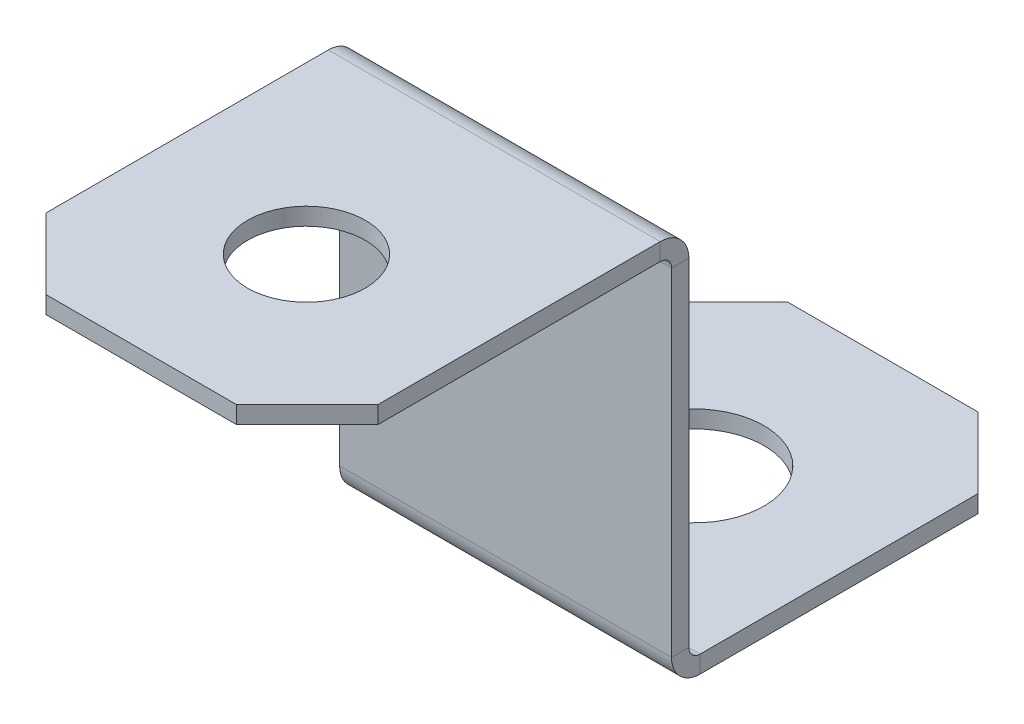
ISO-10303-21;
HEADER;
FILE_DESCRIPTION(('STEP AP214'),'2;1');
FILE_NAME('part.step','',(''),(''),'','','');
FILE_SCHEMA(('AUTOMOTIVE_DESIGN { 1 0 10303 214 1 1 1 1 }'));
ENDSEC;
DATA;
#1=APPLICATION_CONTEXT('core data for automotive mechanical design processes');
#2=APPLICATION_PROTOCOL_DEFINITION('international standard','automotive_design',2000,#1);
#3=PRODUCT_CONTEXT('',#1,'mechanical');
#4=PRODUCT('Part','Part','',(#3));
#5=PRODUCT_RELATED_PRODUCT_CATEGORY('part','',(#4));
#6=PRODUCT_DEFINITION_FORMATION('','',#4);
#7=PRODUCT_DEFINITION_CONTEXT('part definition',#1,'design');
#8=PRODUCT_DEFINITION('design','',#6,#7);
#9=PRODUCT_DEFINITION_SHAPE('','',#8);
#10=(LENGTH_UNIT() NAMED_UNIT(*) SI_UNIT(.MILLI.,.METRE.));
#11=(NAMED_UNIT(*) PLANE_ANGLE_UNIT() SI_UNIT($,.RADIAN.));
#12=(NAMED_UNIT(*) SI_UNIT($,.STERADIAN.) SOLID_ANGLE_UNIT());
#13=UNCERTAINTY_MEASURE_WITH_UNIT(LENGTH_MEASURE(1.E-05),#10,'distance_accuracy_value','');
#14=(GEOMETRIC_REPRESENTATION_CONTEXT(3) GLOBAL_UNCERTAINTY_ASSIGNED_CONTEXT((#13)) GLOBAL_UNIT_ASSIGNED_CONTEXT((#10,
#11,#12)) REPRESENTATION_CONTEXT('',''));
#15=CARTESIAN_POINT('',(0.,0.,0.));
#16=DIRECTION('',(0.,0.,1.));
#17=DIRECTION('',(1.,0.,0.));
#18=AXIS2_PLACEMENT_3D('',#15,#16,#17);
#19=CARTESIAN_POINT('',(5.588,-0.9652,-7.2898));
#20=DIRECTION('',(1.,0.,0.));
#21=DIRECTION('',(0.,0.,-1.));
#22=AXIS2_PLACEMENT_3D('',#19,#20,#21);
#23=PLANE('',#22);
#24=DIRECTION('',(0.,0.,1.));
#25=VECTOR('',#24,1.);
#26=CARTESIAN_POINT('',(5.588,-0.9652,-7.2898));
#27=LINE('',#26,#25);
#28=CARTESIAN_POINT('',(5.588,-0.9652,-7.2898));
#29=VERTEX_POINT('',#28);
#30=CARTESIAN_POINT('',(5.588,-0.9652,-6.7056));
#31=VERTEX_POINT('',#30);
#32=EDGE_CURVE('E272',#29,#31,#27,.T.);
#33=ORIENTED_EDGE('',*,*,#32,.F.);
#34=CARTESIAN_POINT('',(5.588,-0.9652,-6.3246));
#35=DIRECTION('',(1.,0.,0.));
#36=DIRECTION('',(0.,0.,-1.));
#37=AXIS2_PLACEMENT_3D('',#34,#35,#36);
#38=CIRCLE('',#37,0.9652);
#39=CARTESIAN_POINT('',(5.588,0.,-6.3246));
#40=VERTEX_POINT('',#39);
#41=EDGE_CURVE('E189',#40,#29,#38,.F.);
#42=ORIENTED_EDGE('',*,*,#41,.F.);
#43=DIRECTION('',(0.,1.,0.));
#44=VECTOR('',#43,1.);
#45=CARTESIAN_POINT('',(5.588,-0.5842,-6.3246));
#46=LINE('',#45,#44);
#47=CARTESIAN_POINT('',(5.588,-0.5842,-6.3246));
#48=VERTEX_POINT('',#47);
#49=EDGE_CURVE('E269',#48,#40,#46,.T.);
#50=ORIENTED_EDGE('',*,*,#49,.F.);
#51=CARTESIAN_POINT('',(5.588,-0.9652,-6.3246));
#52=DIRECTION('',(1.,0.,0.));
#53=DIRECTION('',(0.,0.,-1.));
#54=AXIS2_PLACEMENT_3D('',#51,#52,#53);
#55=CIRCLE('',#54,0.381);
#56=EDGE_CURVE('E199',#48,#31,#55,.F.);
#57=ORIENTED_EDGE('',*,*,#56,.T.);
#58=EDGE_LOOP('',(#33,#42,#50,#57));
#59=FACE_BOUND('',#58,.T.);
#60=ADVANCED_FACE('F39',(#59),#23,.T.);
#61=CARTESIAN_POINT('',(5.588,-0.5842,-6.3246));
#62=DIRECTION('',(1.,0.,0.));
#63=DIRECTION('',(0.,0.,-1.));
#64=AXIS2_PLACEMENT_3D('',#61,#62,#63);
#65=PLANE('',#64);
#66=DIRECTION('',(0.,-1.,0.));
#67=VECTOR('',#66,1.);
#68=CARTESIAN_POINT('',(5.588,0.,-7.2898));
#69=LINE('',#68,#67);
#70=CARTESIAN_POINT('',(5.588,-12.319,-7.2898));
#71=VERTEX_POINT('',#70);
#72=EDGE_CURVE('E187',#29,#71,#69,.T.);
#73=ORIENTED_EDGE('',*,*,#72,.F.);
#74=ORIENTED_EDGE('',*,*,#32,.T.);
#75=DIRECTION('',(0.,-1.,0.));
#76=VECTOR('',#75,1.);
#77=CARTESIAN_POINT('',(5.588,0.,-6.7056));
#78=LINE('',#77,#76);
#79=CARTESIAN_POINT('',(5.588,-12.319,-6.7056));
#80=VERTEX_POINT('',#79);
#81=EDGE_CURVE('E202',#31,#80,#78,.T.);
#82=ORIENTED_EDGE('',*,*,#81,.T.);
#83=DIRECTION('',(0.,0.,-1.));
#84=VECTOR('',#83,1.);
#85=CARTESIAN_POINT('',(5.588,-12.319,-6.7056));
#86=LINE('',#85,#84);
#87=EDGE_CURVE('E164',#80,#71,#86,.T.);
#88=ORIENTED_EDGE('',*,*,#87,.T.);
#89=EDGE_LOOP('',(#73,#74,#82,#88));
#90=FACE_BOUND('',#89,.T.);
#91=ADVANCED_FACE('F349',(#90),#65,.T.);
#92=CARTESIAN_POINT('',(-5.588,0.,-6.3246));
#93=DIRECTION('',(-1.,0.,0.));
#94=DIRECTION('',(0.,0.,1.));
#95=AXIS2_PLACEMENT_3D('',#92,#93,#94);
#96=PLANE('',#95);
#97=DIRECTION('',(0.,-1.,0.));
#98=VECTOR('',#97,1.);
#99=CARTESIAN_POINT('',(-5.588,0.,-6.3246));
#100=LINE('',#99,#98);
#101=CARTESIAN_POINT('',(-5.588,0.,-6.3246));
#102=VERTEX_POINT('',#101);
#103=CARTESIAN_POINT('',(-5.588,-0.5842,-6.3246));
#104=VERTEX_POINT('',#103);
#105=EDGE_CURVE('E266',#102,#104,#100,.T.);
#106=ORIENTED_EDGE('',*,*,#105,.F.);
#107=CARTESIAN_POINT('',(-5.588,-0.9652,-6.3246));
#108=DIRECTION('',(1.,0.,0.));
#109=DIRECTION('',(0.,0.,-1.));
#110=AXIS2_PLACEMENT_3D('',#107,#108,#109);
#111=CIRCLE('',#110,0.9652);
#112=CARTESIAN_POINT('',(-5.588,-0.9652,-7.2898));
#113=VERTEX_POINT('',#112);
#114=EDGE_CURVE('E217',#102,#113,#111,.F.);
#115=ORIENTED_EDGE('',*,*,#114,.T.);
#116=DIRECTION('',(0.,0.,-1.));
#117=VECTOR('',#116,1.);
#118=CARTESIAN_POINT('',(-5.588,-0.9652,-6.7056));
#119=LINE('',#118,#117);
#120=CARTESIAN_POINT('',(-5.588,-0.9652,-6.7056));
#121=VERTEX_POINT('',#120);
#122=EDGE_CURVE('E163',#121,#113,#119,.T.);
#123=ORIENTED_EDGE('',*,*,#122,.F.);
#124=CARTESIAN_POINT('',(-5.588,-0.9652,-6.3246));
#125=DIRECTION('',(1.,0.,0.));
#126=DIRECTION('',(0.,0.,-1.));
#127=AXIS2_PLACEMENT_3D('',#124,#125,#126);
#128=CIRCLE('',#127,0.381);
#129=EDGE_CURVE('E224',#104,#121,#128,.F.);
#130=ORIENTED_EDGE('',*,*,#129,.F.);
#131=EDGE_LOOP('',(#106,#115,#123,#130));
#132=FACE_BOUND('',#131,.T.);
#133=ADVANCED_FACE('F355',(#132),#96,.T.);
#134=CARTESIAN_POINT('',(-5.588,-0.9652,-6.7056));
#135=DIRECTION('',(-1.,0.,0.));
#136=DIRECTION('',(0.,0.,1.));
#137=AXIS2_PLACEMENT_3D('',#134,#135,#136);
#138=PLANE('',#137);
#139=DIRECTION('',(0.,0.,-1.));
#140=VECTOR('',#139,1.);
#141=CARTESIAN_POINT('',(-5.588,-0.5842,5.5626));
#142=LINE('',#141,#140);
#143=CARTESIAN_POINT('',(-5.588,-0.5842,3.18135));
#144=VERTEX_POINT('',#143);
#145=EDGE_CURVE('E222',#144,#104,#142,.T.);
#146=ORIENTED_EDGE('',*,*,#145,.F.);
#147=DIRECTION('',(0.,1.,0.));
#148=VECTOR('',#147,1.);
#149=CARTESIAN_POINT('',(-5.588,-0.9652,3.18135));
#150=LINE('',#149,#148);
#151=CARTESIAN_POINT('',(-5.588,0.,3.18135));
#152=VERTEX_POINT('',#151);
#153=EDGE_CURVE('E274',#144,#152,#150,.T.);
#154=ORIENTED_EDGE('',*,*,#153,.T.);
#155=DIRECTION('',(0.,0.,-1.));
#156=VECTOR('',#155,1.);
#157=CARTESIAN_POINT('',(-5.588,0.,5.5626));
#158=LINE('',#157,#156);
#159=EDGE_CURVE('E220',#152,#102,#158,.T.);
#160=ORIENTED_EDGE('',*,*,#159,.T.);
#161=ORIENTED_EDGE('',*,*,#105,.T.);
#162=EDGE_LOOP('',(#146,#154,#160,#161));
#163=FACE_BOUND('',#162,.T.);
#164=ADVANCED_FACE('F453',(#163),#138,.T.);
#165=CARTESIAN_POINT('',(5.588,-12.7,-7.6708));
#166=DIRECTION('',(1.,0.,0.));
#167=DIRECTION('',(0.,0.,-1.));
#168=AXIS2_PLACEMENT_3D('',#165,#166,#167);
#169=PLANE('',#168);
#170=DIRECTION('',(0.,-1.,0.));
#171=VECTOR('',#170,1.);
#172=CARTESIAN_POINT('',(5.588,-12.7,-7.6708));
#173=LINE('',#172,#171);
#174=CARTESIAN_POINT('',(5.588,-12.7,-7.6708));
#175=VERTEX_POINT('',#174);
#176=CARTESIAN_POINT('',(5.588,-13.2842,-7.6708));
#177=VERTEX_POINT('',#176);
#178=EDGE_CURVE('E154',#175,#177,#173,.T.);
#179=ORIENTED_EDGE('',*,*,#178,.F.);
#180=CARTESIAN_POINT('',(5.588,-12.319,-7.6708));
#181=DIRECTION('',(-1.,0.,0.));
#182=DIRECTION('',(0.,0.,1.));
#183=AXIS2_PLACEMENT_3D('',#180,#181,#182);
#184=CIRCLE('',#183,0.381);
#185=EDGE_CURVE('E158',#71,#175,#184,.F.);
#186=ORIENTED_EDGE('',*,*,#185,.F.);
#187=ORIENTED_EDGE('',*,*,#87,.F.);
#188=CARTESIAN_POINT('',(5.588,-12.319,-7.6708));
#189=DIRECTION('',(1.,0.,0.));
#190=DIRECTION('',(0.,0.,-1.));
#191=AXIS2_PLACEMENT_3D('',#188,#189,#190);
#192=CIRCLE('',#191,0.9652);
#193=EDGE_CURVE('E161',#80,#177,#192,.T.);
#194=ORIENTED_EDGE('',*,*,#193,.T.);
#195=EDGE_LOOP('',(#179,#186,#187,#194));
#196=FACE_BOUND('',#195,.T.);
#197=ADVANCED_FACE('F156',(#196),#169,.T.);
#198=CARTESIAN_POINT('',(5.588,-12.319,-6.7056));
#199=DIRECTION('',(1.,0.,0.));
#200=DIRECTION('',(0.,0.,-1.));
#201=AXIS2_PLACEMENT_3D('',#198,#199,#200);
#202=PLANE('',#201);
#203=DIRECTION('',(0.,0.,-1.));
#204=VECTOR('',#203,1.);
#205=CARTESIAN_POINT('',(5.588,-13.2842,-7.2898));
#206=LINE('',#205,#204);
#207=CARTESIAN_POINT('',(5.588,-13.2842,-17.02435));
#208=VERTEX_POINT('',#207);
#209=EDGE_CURVE('E182',#177,#208,#206,.T.);
#210=ORIENTED_EDGE('',*,*,#209,.T.);
#211=DIRECTION('',(0.,1.,0.));
#212=VECTOR('',#211,1.);
#213=CARTESIAN_POINT('',(5.588,-12.319,-17.02435));
#214=LINE('',#213,#212);
#215=CARTESIAN_POINT('',(5.588,-12.7,-17.02435));
#216=VERTEX_POINT('',#215);
#217=EDGE_CURVE('E11',#208,#216,#214,.T.);
#218=ORIENTED_EDGE('',*,*,#217,.T.);
#219=DIRECTION('',(0.,0.,-1.));
#220=VECTOR('',#219,1.);
#221=CARTESIAN_POINT('',(5.588,-12.7,-7.2898));
#222=LINE('',#221,#220);
#223=EDGE_CURVE('E171',#175,#216,#222,.T.);
#224=ORIENTED_EDGE('',*,*,#223,.F.);
#225=ORIENTED_EDGE('',*,*,#178,.T.);
#226=EDGE_LOOP('',(#210,#218,#224,#225));
#227=FACE_BOUND('',#226,.T.);
#228=ADVANCED_FACE('F181',(#227),#202,.T.);
#229=CARTESIAN_POINT('',(-5.588,-12.319,-7.2898));
#230=DIRECTION('',(-1.,0.,0.));
#231=DIRECTION('',(0.,0.,1.));
#232=AXIS2_PLACEMENT_3D('',#229,#230,#231);
#233=PLANE('',#232);
#234=DIRECTION('',(0.,0.,1.));
#235=VECTOR('',#234,1.);
#236=CARTESIAN_POINT('',(-5.588,-12.319,-7.2898));
#237=LINE('',#236,#235);
#238=CARTESIAN_POINT('',(-5.588,-12.319,-7.2898));
#239=VERTEX_POINT('',#238);
#240=CARTESIAN_POINT('',(-5.588,-12.319,-6.7056));
#241=VERTEX_POINT('',#240);
#242=EDGE_CURVE('E262',#239,#241,#237,.T.);
#243=ORIENTED_EDGE('',*,*,#242,.F.);
#244=CARTESIAN_POINT('',(-5.588,-12.319,-7.6708));
#245=DIRECTION('',(-1.,0.,0.));
#246=DIRECTION('',(0.,0.,1.));
#247=AXIS2_PLACEMENT_3D('',#244,#245,#246);
#248=CIRCLE('',#247,0.381);
#249=CARTESIAN_POINT('',(-5.588,-12.7,-7.6708));
#250=VERTEX_POINT('',#249);
#251=EDGE_CURVE('E212',#239,#250,#248,.F.);
#252=ORIENTED_EDGE('',*,*,#251,.T.);
#253=DIRECTION('',(0.,1.,0.));
#254=VECTOR('',#253,1.);
#255=CARTESIAN_POINT('',(-5.588,-13.2842,-7.6708));
#256=LINE('',#255,#254);
#257=CARTESIAN_POINT('',(-5.588,-13.2842,-7.6708));
#258=VERTEX_POINT('',#257);
#259=EDGE_CURVE('E260',#258,#250,#256,.T.);
#260=ORIENTED_EDGE('',*,*,#259,.F.);
#261=CARTESIAN_POINT('',(-5.588,-12.319,-7.6708));
#262=DIRECTION('',(1.,0.,0.));
#263=DIRECTION('',(0.,0.,-1.));
#264=AXIS2_PLACEMENT_3D('',#261,#262,#263);
#265=CIRCLE('',#264,0.9652);
#266=EDGE_CURVE('E230',#241,#258,#265,.T.);
#267=ORIENTED_EDGE('',*,*,#266,.F.);
#268=EDGE_LOOP('',(#243,#252,#260,#267));
#269=FACE_BOUND('',#268,.T.);
#270=ADVANCED_FACE('F438',(#269),#233,.T.);
#271=CARTESIAN_POINT('',(-5.588,-13.2842,-7.6708));
#272=DIRECTION('',(-1.,0.,0.));
#273=DIRECTION('',(0.,0.,1.));
#274=AXIS2_PLACEMENT_3D('',#271,#272,#273);
#275=PLANE('',#274);
#276=DIRECTION('',(0.,-1.,0.));
#277=VECTOR('',#276,1.);
#278=CARTESIAN_POINT('',(-5.588,0.,-7.2898));
#279=LINE('',#278,#277);
#280=EDGE_CURVE('E214',#113,#239,#279,.T.);
#281=ORIENTED_EDGE('',*,*,#280,.T.);
#282=ORIENTED_EDGE('',*,*,#242,.T.);
#283=DIRECTION('',(0.,-1.,0.));
#284=VECTOR('',#283,1.);
#285=CARTESIAN_POINT('',(-5.588,0.,-6.7056));
#286=LINE('',#285,#284);
#287=EDGE_CURVE('E227',#121,#241,#286,.T.);
#288=ORIENTED_EDGE('',*,*,#287,.F.);
#289=ORIENTED_EDGE('',*,*,#122,.T.);
#290=EDGE_LOOP('',(#281,#282,#288,#289));
#291=FACE_BOUND('',#290,.T.);
#292=ADVANCED_FACE('F439',(#291),#275,.T.);
#293=CARTESIAN_POINT('',(5.588,-13.2842,-7.2898));
#294=DIRECTION('',(0.,1.,0.));
#295=DIRECTION('',(0.,0.,1.));
#296=AXIS2_PLACEMENT_3D('',#293,#294,#295);
#297=PLANE('',#296);
#298=CARTESIAN_POINT('',(0.,-13.2842,-13.0556));
#299=DIRECTION('',(0.,1.,0.));
#300=DIRECTION('',(0.,0.,1.));
#301=AXIS2_PLACEMENT_3D('',#298,#299,#300);
#302=CIRCLE('',#301,2.3495);
#303=CARTESIAN_POINT('',(0.,-13.2842,-10.7061));
#304=VERTEX_POINT('',#303);
#305=EDGE_CURVE('E322',#304,#304,#302,.T.);
#306=ORIENTED_EDGE('',*,*,#305,.T.);
#307=EDGE_LOOP('',(#306));
#308=FACE_BOUND('',#307,.T.);
#309=DIRECTION('',(0.,0.,-1.));
#310=VECTOR('',#309,1.);
#311=CARTESIAN_POINT('',(-5.588,-13.2842,-7.2898));
#312=LINE('',#311,#310);
#313=CARTESIAN_POINT('',(-5.588,-13.2842,-17.02435));
#314=VERTEX_POINT('',#313);
#315=EDGE_CURVE('E207',#258,#314,#312,.T.);
#316=ORIENTED_EDGE('',*,*,#315,.T.);
#317=DIRECTION('',(-0.707106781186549,0.,0.707106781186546));
#318=VECTOR('',#317,1.);
#319=CARTESIAN_POINT('',(-5.588,-13.2842,-17.02435));
#320=LINE('',#319,#318);
#321=CARTESIAN_POINT('',(-3.20675,-13.2842,-19.4056));
#322=VERTEX_POINT('',#321);
#323=EDGE_CURVE('E297',#314,#322,#320,.F.);
#324=ORIENTED_EDGE('',*,*,#323,.T.);
#325=DIRECTION('',(-1.,0.,0.));
#326=VECTOR('',#325,1.);
#327=CARTESIAN_POINT('',(5.588,-13.2842,-19.4056));
#328=LINE('',#327,#326);
#329=CARTESIAN_POINT('',(3.20675,-13.2842,-19.4056));
#330=VERTEX_POINT('',#329);
#331=EDGE_CURVE('E258',#330,#322,#328,.T.);
#332=ORIENTED_EDGE('',*,*,#331,.F.);
#333=DIRECTION('',(-0.707106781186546,0.,-0.707106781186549));
#334=VECTOR('',#333,1.);
#335=CARTESIAN_POINT('',(3.20675,-13.2842,-19.4056));
#336=LINE('',#335,#334);
#337=EDGE_CURVE('E295',#330,#208,#336,.F.);
#338=ORIENTED_EDGE('',*,*,#337,.T.);
#339=ORIENTED_EDGE('',*,*,#209,.F.);
#340=DIRECTION('',(-1.,0.,0.));
#341=VECTOR('',#340,1.);
#342=CARTESIAN_POINT('',(5.588,-13.2842,-7.6708));
#343=LINE('',#342,#341);
#344=EDGE_CURVE('E206',#177,#258,#343,.T.);
#345=ORIENTED_EDGE('',*,*,#344,.T.);
#346=EDGE_LOOP('',(#316,#324,#332,#338,#339,#345));
#347=FACE_BOUND('',#346,.T.);
#348=ADVANCED_FACE('F313',(#308,#347),#297,.F.);
#349=CARTESIAN_POINT('',(5.588,-12.7,-19.4056));
#350=DIRECTION('',(0.,0.,-1.));
#351=DIRECTION('',(-1.,0.,0.));
#352=AXIS2_PLACEMENT_3D('',#349,#350,#351);
#353=PLANE('',#352);
#354=ORIENTED_EDGE('',*,*,#331,.T.);
#355=DIRECTION('',(0.,1.,0.));
#356=VECTOR('',#355,1.);
#357=CARTESIAN_POINT('',(-3.20675,-12.7,-19.4056));
#358=LINE('',#357,#356);
#359=CARTESIAN_POINT('',(-3.20675,-12.7,-19.4056));
#360=VERTEX_POINT('',#359);
#361=EDGE_CURVE('E60',#322,#360,#358,.T.);
#362=ORIENTED_EDGE('',*,*,#361,.T.);
#363=DIRECTION('',(-1.,0.,0.));
#364=VECTOR('',#363,1.);
#365=CARTESIAN_POINT('',(5.588,-12.7,-19.4056));
#366=LINE('',#365,#364);
#367=CARTESIAN_POINT('',(3.20675,-12.7,-19.4056));
#368=VERTEX_POINT('',#367);
#369=EDGE_CURVE('E178',#368,#360,#366,.T.);
#370=ORIENTED_EDGE('',*,*,#369,.F.);
#371=DIRECTION('',(0.,-1.,0.));
#372=VECTOR('',#371,1.);
#373=CARTESIAN_POINT('',(3.20675,-12.7,-19.4056));
#374=LINE('',#373,#372);
#375=EDGE_CURVE('E299',#368,#330,#374,.T.);
#376=ORIENTED_EDGE('',*,*,#375,.T.);
#377=EDGE_LOOP('',(#354,#362,#370,#376));
#378=FACE_BOUND('',#377,.T.);
#379=ADVANCED_FACE('F314',(#378),#353,.T.);
#380=CARTESIAN_POINT('',(5.588,-12.7,-7.2898));
#381=DIRECTION('',(0.,1.,0.));
#382=DIRECTION('',(0.,0.,1.));
#383=AXIS2_PLACEMENT_3D('',#380,#381,#382);
#384=PLANE('',#383);
#385=CARTESIAN_POINT('',(0.,-12.7,-13.0556));
#386=DIRECTION('',(0.,1.,0.));
#387=DIRECTION('',(0.,0.,1.));
#388=AXIS2_PLACEMENT_3D('',#385,#386,#387);
#389=CIRCLE('',#388,2.3495);
#390=CARTESIAN_POINT('',(0.,-12.7,-10.7061));
#391=VERTEX_POINT('',#390);
#392=EDGE_CURVE('E325',#391,#391,#389,.T.);
#393=ORIENTED_EDGE('',*,*,#392,.F.);
#394=EDGE_LOOP('',(#393));
#395=FACE_BOUND('',#394,.T.);
#396=ORIENTED_EDGE('',*,*,#369,.T.);
#397=DIRECTION('',(0.707106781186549,0.,-0.707106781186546));
#398=VECTOR('',#397,1.);
#399=CARTESIAN_POINT('',(-4.86727499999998,-12.7,-17.745075));
#400=LINE('',#399,#398);
#401=CARTESIAN_POINT('',(-5.588,-12.7,-17.02435));
#402=VERTEX_POINT('',#401);
#403=EDGE_CURVE('E47',#360,#402,#400,.F.);
#404=ORIENTED_EDGE('',*,*,#403,.T.);
#405=DIRECTION('',(0.,0.,-1.));
#406=VECTOR('',#405,1.);
#407=CARTESIAN_POINT('',(-5.588,-12.7,-7.2898));
#408=LINE('',#407,#406);
#409=EDGE_CURVE('E174',#250,#402,#408,.T.);
#410=ORIENTED_EDGE('',*,*,#409,.F.);
#411=DIRECTION('',(-1.,0.,0.));
#412=VECTOR('',#411,1.);
#413=CARTESIAN_POINT('',(5.588,-12.7,-7.6708));
#414=LINE('',#413,#412);
#415=EDGE_CURVE('E169',#175,#250,#414,.T.);
#416=ORIENTED_EDGE('',*,*,#415,.F.);
#417=ORIENTED_EDGE('',*,*,#223,.T.);
#418=DIRECTION('',(0.707106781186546,0.,0.707106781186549));
#419=VECTOR('',#418,1.);
#420=CARTESIAN_POINT('',(10.455275,-12.7,-12.157075));
#421=LINE('',#420,#419);
#422=EDGE_CURVE('E303',#216,#368,#421,.F.);
#423=ORIENTED_EDGE('',*,*,#422,.T.);
#424=EDGE_LOOP('',(#396,#404,#410,#416,#417,#423));
#425=FACE_BOUND('',#424,.T.);
#426=ADVANCED_FACE('F170',(#395,#425),#384,.T.);
#427=CARTESIAN_POINT('',(5.588,-12.319,-7.6708));
#428=DIRECTION('',(-1.,0.,0.));
#429=DIRECTION('',(0.,0.,1.));
#430=AXIS2_PLACEMENT_3D('',#427,#428,#429);
#431=CYLINDRICAL_SURFACE('',#430,0.381);
#432=ORIENTED_EDGE('',*,*,#251,.F.);
#433=DIRECTION('',(-1.,0.,0.));
#434=VECTOR('',#433,1.);
#435=CARTESIAN_POINT('',(5.588,-12.319,-7.2898));
#436=LINE('',#435,#434);
#437=EDGE_CURVE('E179',#71,#239,#436,.T.);
#438=ORIENTED_EDGE('',*,*,#437,.F.);
#439=ORIENTED_EDGE('',*,*,#185,.T.);
#440=ORIENTED_EDGE('',*,*,#415,.T.);
#441=EDGE_LOOP('',(#432,#438,#439,#440));
#442=FACE_BOUND('',#441,.T.);
#443=ADVANCED_FACE('F185',(#442),#431,.F.);
#444=CARTESIAN_POINT('',(5.588,0.,-7.2898));
#445=DIRECTION('',(0.,0.,-1.));
#446=DIRECTION('',(0.,1.,0.));
#447=AXIS2_PLACEMENT_3D('',#444,#445,#446);
#448=PLANE('',#447);
#449=ORIENTED_EDGE('',*,*,#280,.F.);
#450=DIRECTION('',(-1.,0.,0.));
#451=VECTOR('',#450,1.);
#452=CARTESIAN_POINT('',(5.588,-0.9652,-7.2898));
#453=LINE('',#452,#451);
#454=EDGE_CURVE('E253',#29,#113,#453,.T.);
#455=ORIENTED_EDGE('',*,*,#454,.F.);
#456=ORIENTED_EDGE('',*,*,#72,.T.);
#457=ORIENTED_EDGE('',*,*,#437,.T.);
#458=EDGE_LOOP('',(#449,#455,#456,#457));
#459=FACE_BOUND('',#458,.T.);
#460=ADVANCED_FACE('F345',(#459),#448,.T.);
#461=CARTESIAN_POINT('',(5.588,-0.9652,-6.3246));
#462=DIRECTION('',(-1.,0.,0.));
#463=DIRECTION('',(0.,0.,1.));
#464=AXIS2_PLACEMENT_3D('',#461,#462,#463);
#465=CYLINDRICAL_SURFACE('',#464,0.9652);
#466=ORIENTED_EDGE('',*,*,#114,.F.);
#467=DIRECTION('',(-1.,0.,0.));
#468=VECTOR('',#467,1.);
#469=CARTESIAN_POINT('',(5.588,0.,-6.3246));
#470=LINE('',#469,#468);
#471=EDGE_CURVE('E250',#40,#102,#470,.T.);
#472=ORIENTED_EDGE('',*,*,#471,.F.);
#473=ORIENTED_EDGE('',*,*,#41,.T.);
#474=ORIENTED_EDGE('',*,*,#454,.T.);
#475=EDGE_LOOP('',(#466,#472,#473,#474));
#476=FACE_BOUND('',#475,.T.);
#477=ADVANCED_FACE('F410',(#476),#465,.T.);
#478=CARTESIAN_POINT('',(5.588,0.,5.5626));
#479=DIRECTION('',(0.,1.,0.));
#480=DIRECTION('',(0.,0.,1.));
#481=AXIS2_PLACEMENT_3D('',#478,#479,#480);
#482=PLANE('',#481);
#483=CARTESIAN_POINT('',(0.,0.,0.));
#484=DIRECTION('',(0.,1.,0.));
#485=DIRECTION('',(0.,0.,1.));
#486=AXIS2_PLACEMENT_3D('',#483,#484,#485);
#487=CIRCLE('',#486,1.9812);
#488=CARTESIAN_POINT('',(0.,0.,1.9812));
#489=VERTEX_POINT('',#488);
#490=EDGE_CURVE('E319',#489,#489,#487,.T.);
#491=ORIENTED_EDGE('',*,*,#490,.F.);
#492=EDGE_LOOP('',(#491));
#493=FACE_BOUND('',#492,.T.);
#494=ORIENTED_EDGE('',*,*,#159,.F.);
#495=DIRECTION('',(-0.707106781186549,0.,-0.707106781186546));
#496=VECTOR('',#495,1.);
#497=CARTESIAN_POINT('',(1.19062500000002,0.,9.959975));
#498=LINE('',#497,#496);
#499=CARTESIAN_POINT('',(-3.20674999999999,0.,5.5626));
#500=VERTEX_POINT('',#499);
#501=EDGE_CURVE('E279',#152,#500,#498,.F.);
#502=ORIENTED_EDGE('',*,*,#501,.T.);
#503=DIRECTION('',(-1.,0.,0.));
#504=VECTOR('',#503,1.);
#505=CARTESIAN_POINT('',(5.588,0.,5.5626));
#506=LINE('',#505,#504);
#507=CARTESIAN_POINT('',(3.20675,0.,5.5626));
#508=VERTEX_POINT('',#507);
#509=EDGE_CURVE('E247',#508,#500,#506,.T.);
#510=ORIENTED_EDGE('',*,*,#509,.F.);
#511=DIRECTION('',(0.707106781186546,0.,-0.707106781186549));
#512=VECTOR('',#511,1.);
#513=CARTESIAN_POINT('',(4.397375,0.,4.371975));
#514=LINE('',#513,#512);
#515=CARTESIAN_POINT('',(5.588,0.,3.18134999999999));
#516=VERTEX_POINT('',#515);
#517=EDGE_CURVE('E277',#508,#516,#514,.T.);
#518=ORIENTED_EDGE('',*,*,#517,.T.);
#519=DIRECTION('',(0.,0.,-1.));
#520=VECTOR('',#519,1.);
#521=CARTESIAN_POINT('',(5.588,0.,5.5626));
#522=LINE('',#521,#520);
#523=EDGE_CURVE('E195',#516,#40,#522,.T.);
#524=ORIENTED_EDGE('',*,*,#523,.T.);
#525=ORIENTED_EDGE('',*,*,#471,.T.);
#526=EDGE_LOOP('',(#494,#502,#510,#518,#524,#525));
#527=FACE_BOUND('',#526,.T.);
#528=ADVANCED_FACE('F406',(#493,#527),#482,.T.);
#529=CARTESIAN_POINT('',(5.588,-0.5842,5.5626));
#530=DIRECTION('',(0.,0.,1.));
#531=DIRECTION('',(1.,0.,0.));
#532=AXIS2_PLACEMENT_3D('',#529,#530,#531);
#533=PLANE('',#532);
#534=ORIENTED_EDGE('',*,*,#509,.T.);
#535=DIRECTION('',(0.,-1.,0.));
#536=VECTOR('',#535,1.);
#537=CARTESIAN_POINT('',(-3.20674999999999,-0.5842,5.5626));
#538=LINE('',#537,#536);
#539=CARTESIAN_POINT('',(-3.20674999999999,-0.5842,5.5626));
#540=VERTEX_POINT('',#539);
#541=EDGE_CURVE('E284',#500,#540,#538,.T.);
#542=ORIENTED_EDGE('',*,*,#541,.T.);
#543=DIRECTION('',(-1.,0.,0.));
#544=VECTOR('',#543,1.);
#545=CARTESIAN_POINT('',(5.588,-0.5842,5.5626));
#546=LINE('',#545,#544);
#547=CARTESIAN_POINT('',(3.20675,-0.5842,5.5626));
#548=VERTEX_POINT('',#547);
#549=EDGE_CURVE('E244',#548,#540,#546,.T.);
#550=ORIENTED_EDGE('',*,*,#549,.F.);
#551=DIRECTION('',(0.,1.,0.));
#552=VECTOR('',#551,1.);
#553=CARTESIAN_POINT('',(3.20675,0.,5.5626));
#554=LINE('',#553,#552);
#555=EDGE_CURVE('E281',#548,#508,#554,.T.);
#556=ORIENTED_EDGE('',*,*,#555,.T.);
#557=EDGE_LOOP('',(#534,#542,#550,#556));
#558=FACE_BOUND('',#557,.T.);
#559=ADVANCED_FACE('F402',(#558),#533,.T.);
#560=CARTESIAN_POINT('',(5.588,-0.5842,5.5626));
#561=DIRECTION('',(0.,1.,0.));
#562=DIRECTION('',(0.,0.,1.));
#563=AXIS2_PLACEMENT_3D('',#560,#561,#562);
#564=PLANE('',#563);
#565=CARTESIAN_POINT('',(0.,-0.5842,0.));
#566=DIRECTION('',(0.,1.,0.));
#567=DIRECTION('',(0.,0.,1.));
#568=AXIS2_PLACEMENT_3D('',#565,#566,#567);
#569=CIRCLE('',#568,1.9812);
#570=CARTESIAN_POINT('',(0.,-0.5842,1.9812));
#571=VERTEX_POINT('',#570);
#572=EDGE_CURVE('E210',#571,#571,#569,.T.);
#573=ORIENTED_EDGE('',*,*,#572,.T.);
#574=EDGE_LOOP('',(#573));
#575=FACE_BOUND('',#574,.T.);
#576=ORIENTED_EDGE('',*,*,#549,.T.);
#577=DIRECTION('',(0.707106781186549,0.,0.707106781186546));
#578=VECTOR('',#577,1.);
#579=CARTESIAN_POINT('',(-5.588,-0.5842,3.18135));
#580=LINE('',#579,#578);
#581=EDGE_CURVE('E288',#540,#144,#580,.F.);
#582=ORIENTED_EDGE('',*,*,#581,.T.);
#583=ORIENTED_EDGE('',*,*,#145,.T.);
#584=DIRECTION('',(-1.,0.,0.));
#585=VECTOR('',#584,1.);
#586=CARTESIAN_POINT('',(5.588,-0.5842,-6.3246));
#587=LINE('',#586,#585);
#588=EDGE_CURVE('E241',#48,#104,#587,.T.);
#589=ORIENTED_EDGE('',*,*,#588,.F.);
#590=DIRECTION('',(0.,0.,-1.));
#591=VECTOR('',#590,1.);
#592=CARTESIAN_POINT('',(5.588,-0.5842,5.5626));
#593=LINE('',#592,#591);
#594=CARTESIAN_POINT('',(5.588,-0.5842,3.18134999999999));
#595=VERTEX_POINT('',#594);
#596=EDGE_CURVE('E197',#595,#48,#593,.T.);
#597=ORIENTED_EDGE('',*,*,#596,.F.);
#598=DIRECTION('',(-0.707106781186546,0.,0.707106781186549));
#599=VECTOR('',#598,1.);
#600=CARTESIAN_POINT('',(3.20675,-0.5842,5.5626));
#601=LINE('',#600,#599);
#602=EDGE_CURVE('E286',#595,#548,#601,.T.);
#603=ORIENTED_EDGE('',*,*,#602,.T.);
#604=EDGE_LOOP('',(#576,#582,#583,#589,#597,#603));
#605=FACE_BOUND('',#604,.T.);
#606=ADVANCED_FACE('F398',(#575,#605),#564,.F.);
#607=CARTESIAN_POINT('',(5.588,-0.9652,-6.3246));
#608=DIRECTION('',(-1.,0.,0.));
#609=DIRECTION('',(0.,0.,1.));
#610=AXIS2_PLACEMENT_3D('',#607,#608,#609);
#611=CYLINDRICAL_SURFACE('',#610,0.381);
#612=ORIENTED_EDGE('',*,*,#129,.T.);
#613=DIRECTION('',(-1.,0.,0.));
#614=VECTOR('',#613,1.);
#615=CARTESIAN_POINT('',(5.588,-0.9652,-6.7056));
#616=LINE('',#615,#614);
#617=EDGE_CURVE('E238',#31,#121,#616,.T.);
#618=ORIENTED_EDGE('',*,*,#617,.F.);
#619=ORIENTED_EDGE('',*,*,#56,.F.);
#620=ORIENTED_EDGE('',*,*,#588,.T.);
#621=EDGE_LOOP('',(#612,#618,#619,#620));
#622=FACE_BOUND('',#621,.T.);
#623=ADVANCED_FACE('F394',(#622),#611,.F.);
#624=CARTESIAN_POINT('',(5.588,0.,-6.7056));
#625=DIRECTION('',(0.,0.,-1.));
#626=DIRECTION('',(0.,1.,0.));
#627=AXIS2_PLACEMENT_3D('',#624,#625,#626);
#628=PLANE('',#627);
#629=ORIENTED_EDGE('',*,*,#287,.T.);
#630=DIRECTION('',(-1.,0.,0.));
#631=VECTOR('',#630,1.);
#632=CARTESIAN_POINT('',(5.588,-12.319,-6.7056));
#633=LINE('',#632,#631);
#634=EDGE_CURVE('E235',#80,#241,#633,.T.);
#635=ORIENTED_EDGE('',*,*,#634,.F.);
#636=ORIENTED_EDGE('',*,*,#81,.F.);
#637=ORIENTED_EDGE('',*,*,#617,.T.);
#638=EDGE_LOOP('',(#629,#635,#636,#637));
#639=FACE_BOUND('',#638,.T.);
#640=ADVANCED_FACE('F390',(#639),#628,.F.);
#641=CARTESIAN_POINT('',(5.588,-12.319,-7.6708));
#642=DIRECTION('',(-1.,0.,0.));
#643=DIRECTION('',(0.,0.,1.));
#644=AXIS2_PLACEMENT_3D('',#641,#642,#643);
#645=CYLINDRICAL_SURFACE('',#644,0.9652);
#646=ORIENTED_EDGE('',*,*,#266,.T.);
#647=ORIENTED_EDGE('',*,*,#344,.F.);
#648=ORIENTED_EDGE('',*,*,#193,.F.);
#649=ORIENTED_EDGE('',*,*,#634,.T.);
#650=EDGE_LOOP('',(#646,#647,#648,#649));
#651=FACE_BOUND('',#650,.T.);
#652=ADVANCED_FACE('F384',(#651),#645,.T.);
#653=CARTESIAN_POINT('',(5.588,-12.319,-7.6708));
#654=DIRECTION('',(-1.,0.,0.));
#655=DIRECTION('',(0.,0.,1.));
#656=AXIS2_PLACEMENT_3D('',#653,#654,#655);
#657=PLANE('',#656);
#658=ORIENTED_EDGE('',*,*,#523,.F.);
#659=DIRECTION('',(0.,-1.,0.));
#660=VECTOR('',#659,1.);
#661=CARTESIAN_POINT('',(5.588,-0.5842,3.18134999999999));
#662=LINE('',#661,#660);
#663=EDGE_CURVE('E290',#516,#595,#662,.T.);
#664=ORIENTED_EDGE('',*,*,#663,.T.);
#665=ORIENTED_EDGE('',*,*,#596,.T.);
#666=ORIENTED_EDGE('',*,*,#49,.T.);
#667=EDGE_LOOP('',(#658,#664,#665,#666));
#668=FACE_BOUND('',#667,.T.);
#669=ADVANCED_FACE('F381',(#668),#657,.F.);
#670=CARTESIAN_POINT('',(-5.588,-12.319,-7.6708));
#671=DIRECTION('',(-1.,0.,0.));
#672=DIRECTION('',(0.,0.,1.));
#673=AXIS2_PLACEMENT_3D('',#670,#671,#672);
#674=PLANE('',#673);
#675=ORIENTED_EDGE('',*,*,#409,.T.);
#676=DIRECTION('',(0.,-1.,0.));
#677=VECTOR('',#676,1.);
#678=CARTESIAN_POINT('',(-5.588,-12.319,-17.02435));
#679=LINE('',#678,#677);
#680=EDGE_CURVE('E292',#402,#314,#679,.T.);
#681=ORIENTED_EDGE('',*,*,#680,.T.);
#682=ORIENTED_EDGE('',*,*,#315,.F.);
#683=ORIENTED_EDGE('',*,*,#259,.T.);
#684=EDGE_LOOP('',(#675,#681,#682,#683));
#685=FACE_BOUND('',#684,.T.);
#686=ADVANCED_FACE('F308',(#685),#674,.T.);
#687=CARTESIAN_POINT('',(-5.588,-0.9652,3.18135));
#688=DIRECTION('',(0.707106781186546,0.,-0.707106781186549));
#689=DIRECTION('',(0.,1.,0.));
#690=AXIS2_PLACEMENT_3D('',#687,#688,#689);
#691=PLANE('',#690);
#692=ORIENTED_EDGE('',*,*,#581,.F.);
#693=ORIENTED_EDGE('',*,*,#541,.F.);
#694=ORIENTED_EDGE('',*,*,#501,.F.);
#695=ORIENTED_EDGE('',*,*,#153,.F.);
#696=EDGE_LOOP('',(#692,#693,#694,#695));
#697=FACE_BOUND('',#696,.T.);
#698=ADVANCED_FACE('F360',(#697),#691,.F.);
#699=CARTESIAN_POINT('',(3.20675,-0.5842,5.5626));
#700=DIRECTION('',(0.707106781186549,0.,0.707106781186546));
#701=DIRECTION('',(0.,-1.,0.));
#702=AXIS2_PLACEMENT_3D('',#699,#700,#701);
#703=PLANE('',#702);
#704=ORIENTED_EDGE('',*,*,#602,.F.);
#705=ORIENTED_EDGE('',*,*,#663,.F.);
#706=ORIENTED_EDGE('',*,*,#517,.F.);
#707=ORIENTED_EDGE('',*,*,#555,.F.);
#708=EDGE_LOOP('',(#704,#705,#706,#707));
#709=FACE_BOUND('',#708,.T.);
#710=ADVANCED_FACE('F363',(#709),#703,.T.);
#711=CARTESIAN_POINT('',(-5.588,-12.319,-17.02435));
#712=DIRECTION('',(0.707106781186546,0.,0.707106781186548));
#713=DIRECTION('',(0.,-1.,0.));
#714=AXIS2_PLACEMENT_3D('',#711,#712,#713);
#715=PLANE('',#714);
#716=ORIENTED_EDGE('',*,*,#403,.F.);
#717=ORIENTED_EDGE('',*,*,#361,.F.);
#718=ORIENTED_EDGE('',*,*,#323,.F.);
#719=ORIENTED_EDGE('',*,*,#680,.F.);
#720=EDGE_LOOP('',(#716,#717,#718,#719));
#721=FACE_BOUND('',#720,.T.);
#722=ADVANCED_FACE('F310',(#721),#715,.F.);
#723=CARTESIAN_POINT('',(3.20675,-12.7,-19.4056));
#724=DIRECTION('',(-0.707106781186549,0.,0.707106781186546));
#725=DIRECTION('',(0.,-1.,0.));
#726=AXIS2_PLACEMENT_3D('',#723,#724,#725);
#727=PLANE('',#726);
#728=ORIENTED_EDGE('',*,*,#422,.F.);
#729=ORIENTED_EDGE('',*,*,#217,.F.);
#730=ORIENTED_EDGE('',*,*,#337,.F.);
#731=ORIENTED_EDGE('',*,*,#375,.F.);
#732=EDGE_LOOP('',(#728,#729,#730,#731));
#733=FACE_BOUND('',#732,.T.);
#734=ADVANCED_FACE('F41',(#733),#727,.F.);
#735=CARTESIAN_POINT('',(0.,-0.5842,0.));
#736=DIRECTION('',(0.,1.,0.));
#737=DIRECTION('',(0.,0.,1.));
#738=AXIS2_PLACEMENT_3D('',#735,#736,#737);
#739=CYLINDRICAL_SURFACE('',#738,1.9812);
#740=ORIENTED_EDGE('',*,*,#572,.F.);
#741=EDGE_LOOP('',(#740));
#742=FACE_BOUND('',#741,.T.);
#743=ORIENTED_EDGE('',*,*,#490,.T.);
#744=EDGE_LOOP('',(#743));
#745=FACE_BOUND('',#744,.T.);
#746=ADVANCED_FACE('F335',(#742,#745),#739,.F.);
#747=CARTESIAN_POINT('',(0.,-13.2842,-13.0556));
#748=DIRECTION('',(0.,1.,0.));
#749=DIRECTION('',(0.,0.,1.));
#750=AXIS2_PLACEMENT_3D('',#747,#748,#749);
#751=CYLINDRICAL_SURFACE('',#750,2.3495);
#752=ORIENTED_EDGE('',*,*,#305,.F.);
#753=EDGE_LOOP('',(#752));
#754=FACE_BOUND('',#753,.T.);
#755=ORIENTED_EDGE('',*,*,#392,.T.);
#756=EDGE_LOOP('',(#755));
#757=FACE_BOUND('',#756,.T.);
#758=ADVANCED_FACE('F332',(#754,#757),#751,.F.);
#759=CLOSED_SHELL('',(#60,#91,#133,#164,#197,#228,#270,#292,#348,#379,#426,#443,#460,#477,#528,
#559,#606,#623,#640,#652,#669,#686,#698,#710,#722,#734,#746,#758));
#760=MANIFOLD_SOLID_BREP('B2',#759);
#761=ADVANCED_BREP_SHAPE_REPRESENTATION('',(#18,#760),#14);
#762=SHAPE_DEFINITION_REPRESENTATION(#9,#761);
ENDSEC;
END-ISO-10303-21;
